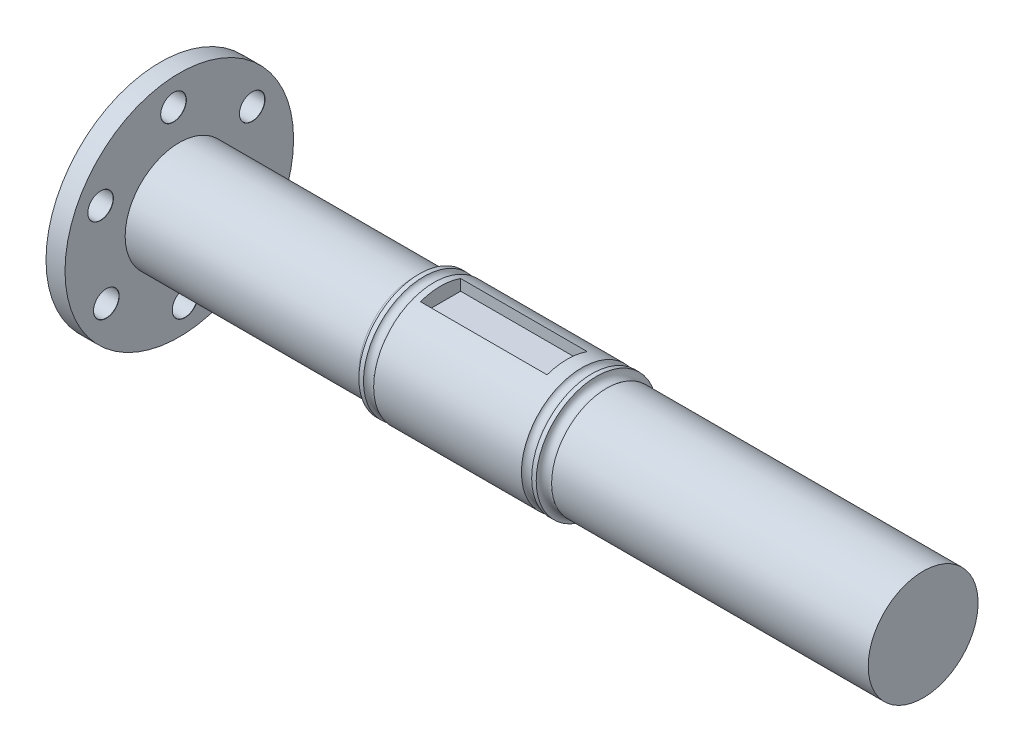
from build123d import *

# Parameters (mm, degrees)
F_4_0MM_DOWEL_HOLE1_AT_2_COUNT = 2
F_4_0MM_DOWEL_HOLE1_AT_2_PITCH = 13.854872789
F_4_0MM_DOWEL_HOLE1_AT_3_COUNT = 2
F_4_0MM_DOWEL_HOLE1_AT_3_PITCH = 13.854872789
F_4_0MM_DOWEL_HOLE1_AT_4_COUNT = 2
F_4_0MM_DOWEL_HOLE1_AT_4_PITCH = 23.997343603
F_4_0MM_DOWEL_HOLE1_AT_5_COUNT = 2
F_4_0MM_DOWEL_HOLE1_AT_5_PITCH = 27.709745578
F_4_0MM_DOWEL_HOLE1_AT_6_COUNT = 2
F_4_0MM_DOWEL_HOLE1_AT_6_PITCH = 23.997343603
F_4_0MM_DOWEL_HOLE1_AT_7_COUNT = 2
F_4_0MM_DOWEL_HOLE1_AT_7_PITCH = 13.854872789
CUT_EXTRUDE1_DEPTH             = 10
CUT_EXTRUDE1_DEPTH_BACK        = 10
SKETCH8_W                      = 6.35
SKETCH8_H                      = 2.362


with BuildPart() as part:
    # Sketch2 → Revolve2 (revolve)
    with BuildSketch(Plane.XY, mode=Mode.PRIVATE) as revolve2_sk:
        with BuildLine():
            Line((15.223236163, 9.461007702), (15.223236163, -1.038992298))
            Line((15.223236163, -1.038992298), (19.723236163, -1.038992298))
            Line((19.723236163, -1.038992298), (19.723236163, -8.588992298))
            Line((19.723236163, -8.588992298), (22.723236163, -8.588992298))
            Line((22.723236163, -8.588992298), (22.723236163, 0.911007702))
            Line((22.723236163, 0.911007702), (59.653236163, 0.911007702))
            ThreePointArc((59.653236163, 0.911007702), (60.33636769, 0.610566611), (60.621250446, -0.079198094))
            Line((60.621250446, -0.079198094), (61.344750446, -0.079198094))
            ThreePointArc((61.344750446, -0.079198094), (62.149677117, 0.426894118), (62.954603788, -0.079198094))
            Line((62.954603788, -0.079198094), (86.291250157, -0.079198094))
            ThreePointArc((86.291250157, -0.079198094), (87.094641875, 0.430370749), (87.901250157, -0.07409108))
            Line((87.901250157, -0.07409108), (88.621250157, -0.075179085))
            ThreePointArc((88.621250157, -0.075179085), (89.139854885, 0.841330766), (90.191429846, 0.785373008))
            Line((90.191429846, 0.785373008), (140.191429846, 0.785373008))
            Line((140.191429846, 0.785373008), (140.191429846, 9.461007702))
            Line((140.191429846, 9.461007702), (15.223236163, 9.461007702))
        make_face()
    revolve(revolve2_sk.sketch.rotate(Axis((15.223236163, 9.461007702, 0), (1, 0, 0)), 270), axis=Axis((15.223236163, 9.461007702, 0), (1, 0, 0)))

    # Sketch6 → 4.0mm Dowel Hole1 (revolve, cut)
    with BuildSketch(Plane(origin=(22.723236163, 17.161007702, -11.51813787), x_dir=(0, 0, -1), z_dir=(0, 1, 0))):
        Polygon((0, 0), (0, 7.5), (2, 7.5), (2, 0.025), (2.025, 0), align=None)
    f_4_0mm_dowel_hole1 = revolve(axis=Axis((29.073236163, 17.161007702, -11.51813787), (-1, 0, 0)), mode=Mode.SUBTRACT)

    # 4.0mm Dowel Hole1 at 2: 4.0mm Dowel Hole1 ×2
    with Locations(*[Vector(0, -0.9978438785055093, -0.06563226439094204) * (i * F_4_0MM_DOWEL_HOLE1_AT_2_PITCH) for i in range(1, F_4_0MM_DOWEL_HOLE1_AT_2_COUNT)]):
        add(f_4_0mm_dowel_hole1, mode=Mode.SUBTRACT)

    # 4.0mm Dowel Hole1 at 3: 4.0mm Dowel Hole1 ×2
    with Locations(*[Vector(0, 0.442082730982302, 0.896974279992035) * (i * F_4_0MM_DOWEL_HOLE1_AT_3_PITCH) for i in range(1, F_4_0MM_DOWEL_HOLE1_AT_3_COUNT)]):
        add(f_4_0mm_dowel_hole1, mode=Mode.SUBTRACT)

    # 4.0mm Dowel Hole1 at 4: 4.0mm Dowel Hole1 ×2
    with Locations(*[Vector(0, -0.896974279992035, 0.44208273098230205) * (i * F_4_0MM_DOWEL_HOLE1_AT_4_PITCH) for i in range(1, F_4_0MM_DOWEL_HOLE1_AT_4_COUNT)]):
        add(f_4_0mm_dowel_hole1, mode=Mode.SUBTRACT)

    # 4.0mm Dowel Hole1 at 5: 4.0mm Dowel Hole1 ×2
    with Locations(*[Vector(0, -0.5557611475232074, 0.8313420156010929) * (i * F_4_0MM_DOWEL_HOLE1_AT_5_PITCH) for i in range(1, F_4_0MM_DOWEL_HOLE1_AT_5_COUNT)]):
        add(f_4_0mm_dowel_hole1, mode=Mode.SUBTRACT)

    # 4.0mm Dowel Hole1 at 6: 4.0mm Dowel Hole1 ×2
    with Locations(*[Vector(0, -0.06563226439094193, 0.9978438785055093) * (i * F_4_0MM_DOWEL_HOLE1_AT_6_PITCH) for i in range(1, F_4_0MM_DOWEL_HOLE1_AT_6_COUNT)]):
        add(f_4_0mm_dowel_hole1, mode=Mode.SUBTRACT)

    # 4.0mm Dowel Hole1 at 7: 4.0mm Dowel Hole1 ×2
    with Locations(*[Vector(0, -0.5557611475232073, 0.831342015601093) * (i * F_4_0MM_DOWEL_HOLE1_AT_7_PITCH) for i in range(1, F_4_0MM_DOWEL_HOLE1_AT_7_COUNT)]):
        add(f_4_0mm_dowel_hole1, mode=Mode.SUBTRACT)

    # Sketch8 → Cut-Extrude1 (cut, two sides: drawn at the far end of the back side and taken through both)
    with BuildSketch(Plane(origin=(73.973236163, 0, 0), x_dir=(0, 0, -1), z_dir=(1, 0, 0)).offset(-CUT_EXTRUDE1_DEPTH_BACK)):
        with Locations((0, 17.896047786)):
            Rectangle(SKETCH8_W, SKETCH8_H)
    extrude(amount=CUT_EXTRUDE1_DEPTH + CUT_EXTRUDE1_DEPTH_BACK, mode=Mode.SUBTRACT)


solid = part.part
